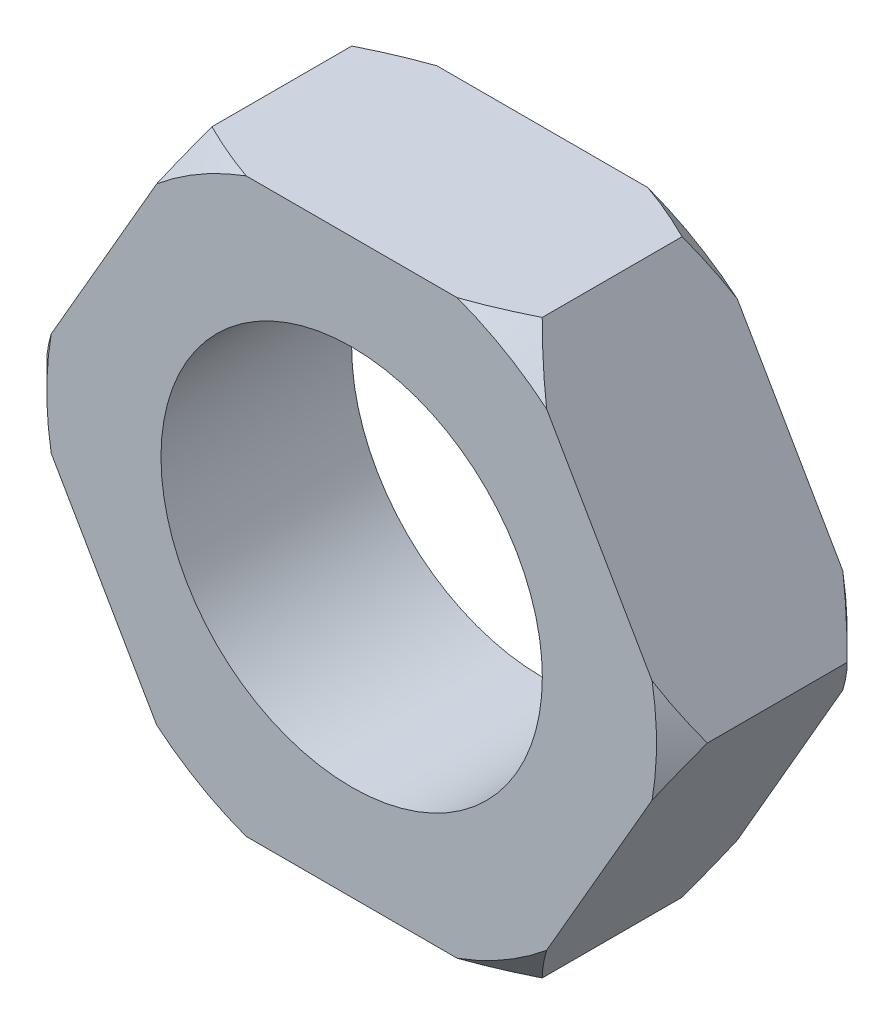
from build123d import *

# Parameters (mm, degrees)
ESQUISSE1_R          = 3
BASE_EXTRUSION_DEPTH = 3


with BuildPart() as part:
    # Esquisse1 → Base-Extrusion (new body)
    with BuildSketch(Plane.XY):
        Polygon((-2.598076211, 4.5), (-5.196152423, 0), (-2.598076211, -4.5), (2.598076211, -4.5), (5.196152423, 0), (2.598076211, 4.5), align=None)
        Circle(ESQUISSE1_R, mode=Mode.SUBTRACT)
    extrude(amount=-BASE_EXTRUSION_DEPTH)

    # Esquisse2 → Enl_vement de mati_re-R_volution1 (revolve, cut)
    with BuildSketch(Plane(origin=(0, 0, 0), x_dir=(1, 0, 0), z_dir=(0, 1, 0))):
        Polygon((-5.196152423, 3), (-4.796152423, 3), (-5.196152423, 2.6), align=None)
        Polygon((-5.196152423, 0), (-4.796152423, 0), (-5.196152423, 0.4), align=None)
    revolve(axis=Axis((0, 0, -8.931643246), (0, 0, 1)), mode=Mode.SUBTRACT)


solid = part.part
